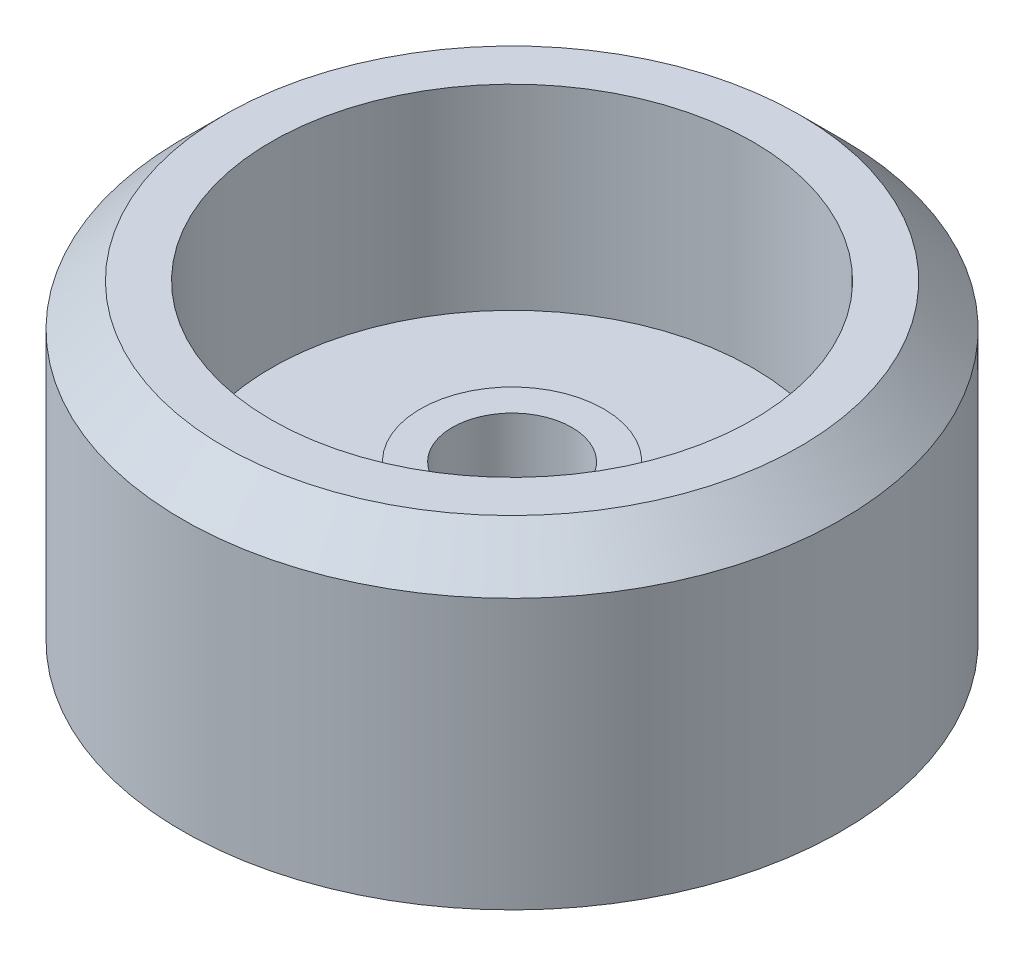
ISO-10303-21;
HEADER;
FILE_DESCRIPTION(('STEP AP214'),'2;1');
FILE_NAME('part.step','',(''),(''),'','','');
FILE_SCHEMA(('AUTOMOTIVE_DESIGN { 1 0 10303 214 1 1 1 1 }'));
ENDSEC;
DATA;
#1=APPLICATION_CONTEXT('core data for automotive mechanical design processes');
#2=APPLICATION_PROTOCOL_DEFINITION('international standard','automotive_design',2000,#1);
#3=PRODUCT_CONTEXT('',#1,'mechanical');
#4=PRODUCT('Part','Part','',(#3));
#5=PRODUCT_RELATED_PRODUCT_CATEGORY('part','',(#4));
#6=PRODUCT_DEFINITION_FORMATION('','',#4);
#7=PRODUCT_DEFINITION_CONTEXT('part definition',#1,'design');
#8=PRODUCT_DEFINITION('design','',#6,#7);
#9=PRODUCT_DEFINITION_SHAPE('','',#8);
#10=(LENGTH_UNIT() NAMED_UNIT(*) SI_UNIT(.MILLI.,.METRE.));
#11=(NAMED_UNIT(*) PLANE_ANGLE_UNIT() SI_UNIT($,.RADIAN.));
#12=(NAMED_UNIT(*) SI_UNIT($,.STERADIAN.) SOLID_ANGLE_UNIT());
#13=UNCERTAINTY_MEASURE_WITH_UNIT(LENGTH_MEASURE(1.E-05),#10,'distance_accuracy_value','');
#14=(GEOMETRIC_REPRESENTATION_CONTEXT(3) GLOBAL_UNCERTAINTY_ASSIGNED_CONTEXT((#13)) GLOBAL_UNIT_ASSIGNED_CONTEXT((#10,
#11,#12)) REPRESENTATION_CONTEXT('',''));
#15=CARTESIAN_POINT('',(0.,0.,0.));
#16=DIRECTION('',(0.,0.,1.));
#17=DIRECTION('',(1.,0.,0.));
#18=AXIS2_PLACEMENT_3D('',#15,#16,#17);
#19=CARTESIAN_POINT('',(0.,-39.4432692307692,0.));
#20=DIRECTION('',(0.,-1.,0.));
#21=DIRECTION('',(0.,0.,-1.));
#22=AXIS2_PLACEMENT_3D('',#19,#20,#21);
#23=CYLINDRICAL_SURFACE('',#22,82.5896478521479);
#24=CARTESIAN_POINT('',(0.,38.5535714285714,0.));
#25=DIRECTION('',(0.,-1.,0.));
#26=DIRECTION('',(0.,0.,-1.));
#27=AXIS2_PLACEMENT_3D('',#24,#25,#26);
#28=CIRCLE('',#27,82.5896478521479);
#29=CARTESIAN_POINT('',(0.,38.5535714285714,-82.5896478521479));
#30=VERTEX_POINT('',#29);
#31=EDGE_CURVE('E10',#30,#30,#28,.T.);
#32=ORIENTED_EDGE('',*,*,#31,.T.);
#33=EDGE_LOOP('',(#32));
#34=FACE_BOUND('',#33,.T.);
#35=CARTESIAN_POINT('',(0.,-29.0634615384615,0.));
#36=DIRECTION('',(0.,-1.,0.));
#37=DIRECTION('',(0.,0.,-1.));
#38=AXIS2_PLACEMENT_3D('',#35,#36,#37);
#39=CIRCLE('',#38,82.5896478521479);
#40=CARTESIAN_POINT('',(0.,-29.0634615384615,-82.5896478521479));
#41=VERTEX_POINT('',#40);
#42=EDGE_CURVE('E62',#41,#41,#39,.T.);
#43=ORIENTED_EDGE('',*,*,#42,.F.);
#44=EDGE_LOOP('',(#43));
#45=FACE_BOUND('',#44,.T.);
#46=ADVANCED_FACE('F31',(#34,#45),#23,.T.);
#47=CARTESIAN_POINT('',(0.,38.5535714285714,0.));
#48=DIRECTION('',(0.,-1.,0.));
#49=DIRECTION('',(0.,0.,-1.));
#50=AXIS2_PLACEMENT_3D('',#47,#48,#49);
#51=CONICAL_SURFACE('',#50,82.5896478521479,0.78539816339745);
#52=CARTESIAN_POINT('',(0.,49.0816620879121,0.));
#53=DIRECTION('',(0.,-1.,0.));
#54=DIRECTION('',(0.,0.,-1.));
#55=AXIS2_PLACEMENT_3D('',#52,#53,#54);
#56=CIRCLE('',#55,72.0615571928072);
#57=CARTESIAN_POINT('',(0.,49.0816620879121,-72.0615571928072));
#58=VERTEX_POINT('',#57);
#59=EDGE_CURVE('E37',#58,#58,#56,.T.);
#60=ORIENTED_EDGE('',*,*,#59,.T.);
#61=EDGE_LOOP('',(#60));
#62=FACE_BOUND('',#61,.T.);
#63=ORIENTED_EDGE('',*,*,#31,.F.);
#64=EDGE_LOOP('',(#63));
#65=FACE_BOUND('',#64,.T.);
#66=ADVANCED_FACE('F70',(#62,#65),#51,.T.);
#67=CARTESIAN_POINT('',(72.0615571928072,49.0816620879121,0.));
#68=DIRECTION('',(0.,1.,0.));
#69=DIRECTION('',(0.,0.,1.));
#70=AXIS2_PLACEMENT_3D('',#67,#68,#69);
#71=PLANE('',#70);
#72=CARTESIAN_POINT('',(0.,49.0816620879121,0.));
#73=DIRECTION('',(0.,-1.,0.));
#74=DIRECTION('',(0.,0.,-1.));
#75=AXIS2_PLACEMENT_3D('',#72,#73,#74);
#76=CIRCLE('',#75,60.3472027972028);
#77=CARTESIAN_POINT('',(0.,49.0816620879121,-60.3472027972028));
#78=VERTEX_POINT('',#77);
#79=EDGE_CURVE('E41',#78,#78,#76,.T.);
#80=ORIENTED_EDGE('',*,*,#79,.T.);
#81=EDGE_LOOP('',(#80));
#82=FACE_BOUND('',#81,.T.);
#83=ORIENTED_EDGE('',*,*,#59,.F.);
#84=EDGE_LOOP('',(#83));
#85=FACE_BOUND('',#84,.T.);
#86=ADVANCED_FACE('F74',(#82,#85),#71,.T.);
#87=CARTESIAN_POINT('',(0.,-39.4432692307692,0.));
#88=DIRECTION('',(0.,-1.,0.));
#89=DIRECTION('',(0.,0.,-1.));
#90=AXIS2_PLACEMENT_3D('',#87,#88,#89);
#91=CYLINDRICAL_SURFACE('',#90,60.3472027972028);
#92=CARTESIAN_POINT('',(0.,0.,0.));
#93=DIRECTION('',(0.,-1.,0.));
#94=DIRECTION('',(0.,0.,-1.));
#95=AXIS2_PLACEMENT_3D('',#92,#93,#94);
#96=CIRCLE('',#95,60.3472027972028);
#97=CARTESIAN_POINT('',(0.,0.,-60.3472027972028));
#98=VERTEX_POINT('',#97);
#99=EDGE_CURVE('E45',#98,#98,#96,.T.);
#100=ORIENTED_EDGE('',*,*,#99,.T.);
#101=EDGE_LOOP('',(#100));
#102=FACE_BOUND('',#101,.T.);
#103=ORIENTED_EDGE('',*,*,#79,.F.);
#104=EDGE_LOOP('',(#103));
#105=FACE_BOUND('',#104,.T.);
#106=ADVANCED_FACE('F78',(#102,#105),#91,.F.);
#107=CARTESIAN_POINT('',(60.3472027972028,0.,0.));
#108=DIRECTION('',(0.,1.,0.));
#109=DIRECTION('',(0.,0.,1.));
#110=AXIS2_PLACEMENT_3D('',#107,#108,#109);
#111=PLANE('',#110);
#112=CARTESIAN_POINT('',(0.,0.,0.));
#113=DIRECTION('',(0.,-1.,0.));
#114=DIRECTION('',(0.,0.,-1.));
#115=AXIS2_PLACEMENT_3D('',#112,#113,#114);
#116=CIRCLE('',#115,22.9798951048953);
#117=CARTESIAN_POINT('',(0.,0.,-22.9798951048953));
#118=VERTEX_POINT('',#117);
#119=EDGE_CURVE('E50',#118,#118,#116,.T.);
#120=ORIENTED_EDGE('',*,*,#119,.T.);
#121=EDGE_LOOP('',(#120));
#122=FACE_BOUND('',#121,.T.);
#123=ORIENTED_EDGE('',*,*,#99,.F.);
#124=EDGE_LOOP('',(#123));
#125=FACE_BOUND('',#124,.T.);
#126=ADVANCED_FACE('F85',(#122,#125),#111,.T.);
#127=CARTESIAN_POINT('',(0.,-39.4432692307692,0.));
#128=DIRECTION('',(0.,-1.,0.));
#129=DIRECTION('',(0.,0.,-1.));
#130=AXIS2_PLACEMENT_3D('',#127,#128,#129);
#131=CYLINDRICAL_SURFACE('',#130,22.9798951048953);
#132=CARTESIAN_POINT('',(0.,9.78667582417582,0.));
#133=DIRECTION('',(0.,-1.,0.));
#134=DIRECTION('',(0.,0.,-1.));
#135=AXIS2_PLACEMENT_3D('',#132,#133,#134);
#136=CIRCLE('',#135,22.9798951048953);
#137=CARTESIAN_POINT('',(0.,9.78667582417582,-22.9798951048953));
#138=VERTEX_POINT('',#137);
#139=EDGE_CURVE('E53',#138,#138,#136,.T.);
#140=ORIENTED_EDGE('',*,*,#139,.T.);
#141=EDGE_LOOP('',(#140));
#142=FACE_BOUND('',#141,.T.);
#143=ORIENTED_EDGE('',*,*,#119,.F.);
#144=EDGE_LOOP('',(#143));
#145=FACE_BOUND('',#144,.T.);
#146=ADVANCED_FACE('F89',(#142,#145),#131,.T.);
#147=CARTESIAN_POINT('',(22.9798951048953,9.78667582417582,0.));
#148=DIRECTION('',(0.,1.,0.));
#149=DIRECTION('',(0.,0.,1.));
#150=AXIS2_PLACEMENT_3D('',#147,#148,#149);
#151=PLANE('',#150);
#152=CARTESIAN_POINT('',(0.,9.78667582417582,0.));
#153=DIRECTION('',(0.,-1.,0.));
#154=DIRECTION('',(0.,0.,-1.));
#155=AXIS2_PLACEMENT_3D('',#152,#153,#154);
#156=CIRCLE('',#155,14.9726148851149);
#157=CARTESIAN_POINT('',(0.,9.78667582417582,-14.9726148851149));
#158=VERTEX_POINT('',#157);
#159=EDGE_CURVE('E56',#158,#158,#156,.T.);
#160=ORIENTED_EDGE('',*,*,#159,.T.);
#161=EDGE_LOOP('',(#160));
#162=FACE_BOUND('',#161,.T.);
#163=ORIENTED_EDGE('',*,*,#139,.F.);
#164=EDGE_LOOP('',(#163));
#165=FACE_BOUND('',#164,.T.);
#166=ADVANCED_FACE('F93',(#162,#165),#151,.T.);
#167=CARTESIAN_POINT('',(0.,-39.4432692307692,0.));
#168=DIRECTION('',(0.,-1.,0.));
#169=DIRECTION('',(0.,0.,-1.));
#170=AXIS2_PLACEMENT_3D('',#167,#168,#169);
#171=CYLINDRICAL_SURFACE('',#170,14.9726148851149);
#172=CARTESIAN_POINT('',(0.,-29.0634615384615,0.));
#173=DIRECTION('',(0.,-1.,0.));
#174=DIRECTION('',(0.,0.,-1.));
#175=AXIS2_PLACEMENT_3D('',#172,#173,#174);
#176=CIRCLE('',#175,14.9726148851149);
#177=CARTESIAN_POINT('',(0.,-29.0634615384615,-14.9726148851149));
#178=VERTEX_POINT('',#177);
#179=EDGE_CURVE('E59',#178,#178,#176,.T.);
#180=ORIENTED_EDGE('',*,*,#179,.T.);
#181=EDGE_LOOP('',(#180));
#182=FACE_BOUND('',#181,.T.);
#183=ORIENTED_EDGE('',*,*,#159,.F.);
#184=EDGE_LOOP('',(#183));
#185=FACE_BOUND('',#184,.T.);
#186=ADVANCED_FACE('F97',(#182,#185),#171,.F.);
#187=CARTESIAN_POINT('',(14.9726148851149,-29.0634615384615,0.));
#188=DIRECTION('',(0.,-1.,0.));
#189=DIRECTION('',(0.,0.,-1.));
#190=AXIS2_PLACEMENT_3D('',#187,#188,#189);
#191=PLANE('',#190);
#192=ORIENTED_EDGE('',*,*,#42,.T.);
#193=EDGE_LOOP('',(#192));
#194=FACE_BOUND('',#193,.T.);
#195=ORIENTED_EDGE('',*,*,#179,.F.);
#196=EDGE_LOOP('',(#195));
#197=FACE_BOUND('',#196,.T.);
#198=ADVANCED_FACE('F66',(#194,#197),#191,.T.);
#199=CLOSED_SHELL('',(#46,#66,#86,#106,#126,#146,#166,#186,#198));
#200=MANIFOLD_SOLID_BREP('B2',#199);
#201=ADVANCED_BREP_SHAPE_REPRESENTATION('',(#18,#200),#14);
#202=SHAPE_DEFINITION_REPRESENTATION(#9,#201);
ENDSEC;
END-ISO-10303-21;
